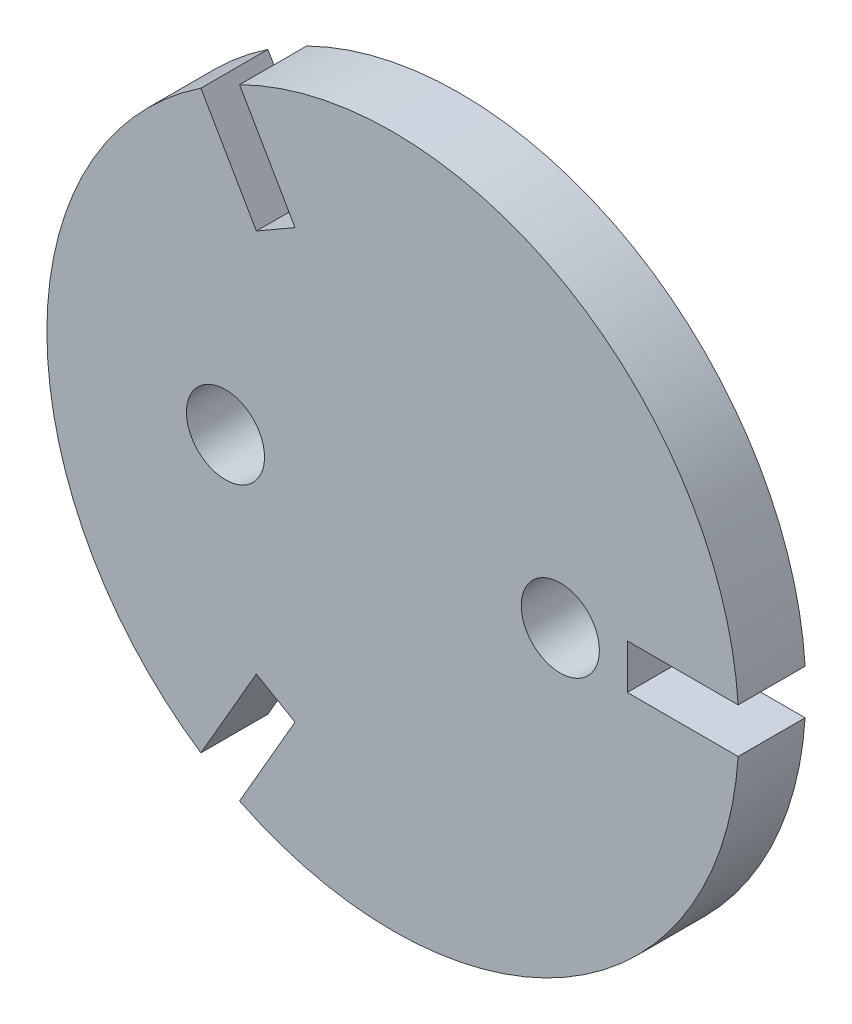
ISO-10303-21;
HEADER;
FILE_DESCRIPTION(('STEP AP214'),'2;1');
FILE_NAME('part.step','',(''),(''),'','','');
FILE_SCHEMA(('AUTOMOTIVE_DESIGN { 1 0 10303 214 1 1 1 1 }'));
ENDSEC;
DATA;
#1=APPLICATION_CONTEXT('core data for automotive mechanical design processes');
#2=APPLICATION_PROTOCOL_DEFINITION('international standard','automotive_design',2000,#1);
#3=PRODUCT_CONTEXT('',#1,'mechanical');
#4=PRODUCT('Part','Part','',(#3));
#5=PRODUCT_RELATED_PRODUCT_CATEGORY('part','',(#4));
#6=PRODUCT_DEFINITION_FORMATION('','',#4);
#7=PRODUCT_DEFINITION_CONTEXT('part definition',#1,'design');
#8=PRODUCT_DEFINITION('design','',#6,#7);
#9=PRODUCT_DEFINITION_SHAPE('','',#8);
#10=(LENGTH_UNIT() NAMED_UNIT(*) SI_UNIT(.MILLI.,.METRE.));
#11=(NAMED_UNIT(*) PLANE_ANGLE_UNIT() SI_UNIT($,.RADIAN.));
#12=(NAMED_UNIT(*) SI_UNIT($,.STERADIAN.) SOLID_ANGLE_UNIT());
#13=UNCERTAINTY_MEASURE_WITH_UNIT(LENGTH_MEASURE(1.E-05),#10,'distance_accuracy_value','');
#14=(GEOMETRIC_REPRESENTATION_CONTEXT(3) GLOBAL_UNCERTAINTY_ASSIGNED_CONTEXT((#13)) GLOBAL_UNIT_ASSIGNED_CONTEXT((#10,
#11,#12)) REPRESENTATION_CONTEXT('',''));
#15=CARTESIAN_POINT('',(0.,0.,0.));
#16=DIRECTION('',(0.,0.,1.));
#17=DIRECTION('',(1.,0.,0.));
#18=AXIS2_PLACEMENT_3D('',#15,#16,#17);
#19=CARTESIAN_POINT('',(0.,0.,3.));
#20=DIRECTION('',(0.,0.,-1.));
#21=DIRECTION('',(-1.,0.,0.));
#22=AXIS2_PLACEMENT_3D('',#19,#20,#21);
#23=CYLINDRICAL_SURFACE('',#22,15.5);
#24=CARTESIAN_POINT('',(0.,0.,0.));
#25=DIRECTION('',(0.,0.,1.));
#26=DIRECTION('',(1.,0.,0.));
#27=AXIS2_PLACEMENT_3D('',#24,#25,#26);
#28=CIRCLE('',#27,15.5);
#29=CARTESIAN_POINT('',(-6.86782874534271,-13.8954283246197,0.));
#30=VERTEX_POINT('',#29);
#31=CARTESIAN_POINT('',(15.467708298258,-1.,0.));
#32=VERTEX_POINT('',#31);
#33=EDGE_CURVE('E203',#30,#32,#28,.T.);
#34=ORIENTED_EDGE('',*,*,#33,.T.);
#35=DIRECTION('',(0.,0.,-1.));
#36=VECTOR('',#35,1.);
#37=CARTESIAN_POINT('',(15.467708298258,-1.,3.));
#38=LINE('',#37,#36);
#39=CARTESIAN_POINT('',(15.467708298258,-1.,3.));
#40=VERTEX_POINT('',#39);
#41=EDGE_CURVE('E11',#32,#40,#38,.F.);
#42=ORIENTED_EDGE('',*,*,#41,.T.);
#43=CARTESIAN_POINT('',(0.,0.,3.));
#44=DIRECTION('',(0.,0.,1.));
#45=DIRECTION('',(1.,0.,0.));
#46=AXIS2_PLACEMENT_3D('',#43,#44,#45);
#47=CIRCLE('',#46,15.5);
#48=CARTESIAN_POINT('',(-6.86782874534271,-13.8954283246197,3.));
#49=VERTEX_POINT('',#48);
#50=EDGE_CURVE('E211',#49,#40,#47,.T.);
#51=ORIENTED_EDGE('',*,*,#50,.F.);
#52=DIRECTION('',(0.,0.,-1.));
#53=VECTOR('',#52,1.);
#54=CARTESIAN_POINT('',(-6.86782874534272,-13.8954283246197,3.));
#55=LINE('',#54,#53);
#56=EDGE_CURVE('E218',#49,#30,#55,.T.);
#57=ORIENTED_EDGE('',*,*,#56,.T.);
#58=EDGE_LOOP('',(#34,#42,#51,#57));
#59=FACE_BOUND('',#58,.T.);
#60=ADVANCED_FACE('F32',(#59),#23,.T.);
#61=CARTESIAN_POINT('',(-8.599879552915,12.8954283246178,0.));
#62=VERTEX_POINT('',#61);
#63=CARTESIAN_POINT('',(-8.59987955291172,-12.89542832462,0.));
#64=VERTEX_POINT('',#63);
#65=EDGE_CURVE('E213',#62,#64,#28,.T.);
#66=ORIENTED_EDGE('',*,*,#65,.T.);
#67=DIRECTION('',(0.,0.,-1.));
#68=VECTOR('',#67,1.);
#69=CARTESIAN_POINT('',(-8.59987955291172,-12.89542832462,3.));
#70=LINE('',#69,#68);
#71=CARTESIAN_POINT('',(-8.59987955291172,-12.89542832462,3.));
#72=VERTEX_POINT('',#71);
#73=EDGE_CURVE('E220',#64,#72,#70,.F.);
#74=ORIENTED_EDGE('',*,*,#73,.T.);
#75=CARTESIAN_POINT('',(-8.599879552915,12.8954283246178,3.));
#76=VERTEX_POINT('',#75);
#77=EDGE_CURVE('E210',#76,#72,#47,.T.);
#78=ORIENTED_EDGE('',*,*,#77,.F.);
#79=DIRECTION('',(0.,0.,-1.));
#80=VECTOR('',#79,1.);
#81=CARTESIAN_POINT('',(-8.599879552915,12.8954283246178,3.));
#82=LINE('',#81,#80);
#83=EDGE_CURVE('E209',#76,#62,#82,.T.);
#84=ORIENTED_EDGE('',*,*,#83,.T.);
#85=EDGE_LOOP('',(#66,#74,#78,#84));
#86=FACE_BOUND('',#85,.T.);
#87=ADVANCED_FACE('F240',(#86),#23,.T.);
#88=CARTESIAN_POINT('',(0.,0.,3.));
#89=DIRECTION('',(0.,0.,1.));
#90=DIRECTION('',(1.,0.,0.));
#91=AXIS2_PLACEMENT_3D('',#88,#89,#90);
#92=PLANE('',#91);
#93=DIRECTION('',(1.,0.,0.));
#94=VECTOR('',#93,1.);
#95=CARTESIAN_POINT('',(16.2130393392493,-1.,3.));
#96=LINE('',#95,#94);
#97=CARTESIAN_POINT('',(10.5,-1.,3.));
#98=VERTEX_POINT('',#97);
#99=EDGE_CURVE('E147',#98,#40,#96,.T.);
#100=ORIENTED_EDGE('',*,*,#99,.F.);
#101=DIRECTION('',(0.,-1.,0.));
#102=VECTOR('',#101,1.);
#103=CARTESIAN_POINT('',(10.5,-1.,3.));
#104=LINE('',#103,#102);
#105=CARTESIAN_POINT('',(10.5,0.999999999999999,3.));
#106=VERTEX_POINT('',#105);
#107=EDGE_CURVE('E149',#106,#98,#104,.T.);
#108=ORIENTED_EDGE('',*,*,#107,.F.);
#109=DIRECTION('',(-1.,0.,0.));
#110=VECTOR('',#109,1.);
#111=CARTESIAN_POINT('',(16.2130393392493,1.,3.));
#112=LINE('',#111,#110);
#113=CARTESIAN_POINT('',(15.467708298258,1.,3.));
#114=VERTEX_POINT('',#113);
#115=EDGE_CURVE('E127',#114,#106,#112,.T.);
#116=ORIENTED_EDGE('',*,*,#115,.F.);
#117=CARTESIAN_POINT('',(-6.86782874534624,13.895428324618,3.));
#118=VERTEX_POINT('',#117);
#119=EDGE_CURVE('E206',#114,#118,#47,.T.);
#120=ORIENTED_EDGE('',*,*,#119,.T.);
#121=DIRECTION('',(-0.5,0.866025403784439,0.));
#122=VECTOR('',#121,1.);
#123=CARTESIAN_POINT('',(-7.24049426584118,14.5409039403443,3.));
#124=LINE('',#123,#122);
#125=CARTESIAN_POINT('',(-4.38397459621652,9.59326673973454,3.));
#126=VERTEX_POINT('',#125);
#127=EDGE_CURVE('E179',#126,#118,#124,.T.);
#128=ORIENTED_EDGE('',*,*,#127,.F.);
#129=DIRECTION('',(0.866025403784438,0.500000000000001,0.));
#130=VECTOR('',#129,1.);
#131=CARTESIAN_POINT('',(-4.38397459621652,9.59326673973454,3.));
#132=LINE('',#131,#130);
#133=CARTESIAN_POINT('',(-6.11602540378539,8.59326673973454,3.));
#134=VERTEX_POINT('',#133);
#135=EDGE_CURVE('E187',#134,#126,#132,.T.);
#136=ORIENTED_EDGE('',*,*,#135,.F.);
#137=DIRECTION('',(0.5,-0.866025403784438,0.));
#138=VECTOR('',#137,1.);
#139=CARTESIAN_POINT('',(-8.97254507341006,13.5409039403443,3.));
#140=LINE('',#139,#138);
#141=EDGE_CURVE('E185',#76,#134,#140,.T.);
#142=ORIENTED_EDGE('',*,*,#141,.F.);
#143=ORIENTED_EDGE('',*,*,#77,.T.);
#144=DIRECTION('',(-0.499999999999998,-0.86602540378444,0.));
#145=VECTOR('',#144,1.);
#146=CARTESIAN_POINT('',(-8.97254507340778,-13.5409039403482,3.));
#147=LINE('',#146,#145);
#148=CARTESIAN_POINT('',(-6.11602540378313,-8.59326673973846,3.));
#149=VERTEX_POINT('',#148);
#150=EDGE_CURVE('E160',#149,#72,#147,.T.);
#151=ORIENTED_EDGE('',*,*,#150,.F.);
#152=DIRECTION('',(-0.866025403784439,0.5,0.));
#153=VECTOR('',#152,1.);
#154=CARTESIAN_POINT('',(-6.11602540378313,-8.59326673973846,3.));
#155=LINE('',#154,#153);
#156=CARTESIAN_POINT('',(-4.38397459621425,-9.59326673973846,3.));
#157=VERTEX_POINT('',#156);
#158=EDGE_CURVE('E169',#157,#149,#155,.T.);
#159=ORIENTED_EDGE('',*,*,#158,.F.);
#160=DIRECTION('',(0.5,0.866025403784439,0.));
#161=VECTOR('',#160,1.);
#162=CARTESIAN_POINT('',(-7.24049426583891,-14.5409039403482,3.));
#163=LINE('',#162,#161);
#164=EDGE_CURVE('E167',#49,#157,#163,.T.);
#165=ORIENTED_EDGE('',*,*,#164,.F.);
#166=ORIENTED_EDGE('',*,*,#50,.T.);
#167=EDGE_LOOP('',(#100,#108,#116,#120,#128,#136,#142,#143,#151,#159,#165,#166));
#168=FACE_BOUND('',#167,.T.);
#169=CARTESIAN_POINT('',(7.5,0.,3.));
#170=DIRECTION('',(0.,0.,1.));
#171=DIRECTION('',(1.,0.,0.));
#172=AXIS2_PLACEMENT_3D('',#169,#170,#171);
#173=CIRCLE('',#172,1.75);
#174=CARTESIAN_POINT('',(9.25,0.,3.));
#175=VERTEX_POINT('',#174);
#176=EDGE_CURVE('E200',#175,#175,#173,.T.);
#177=ORIENTED_EDGE('',*,*,#176,.F.);
#178=EDGE_LOOP('',(#177));
#179=FACE_BOUND('',#178,.T.);
#180=CARTESIAN_POINT('',(-7.5,0.,3.));
#181=DIRECTION('',(0.,0.,1.));
#182=DIRECTION('',(1.,0.,0.));
#183=AXIS2_PLACEMENT_3D('',#180,#181,#182);
#184=CIRCLE('',#183,1.75);
#185=CARTESIAN_POINT('',(-5.75,0.,3.));
#186=VERTEX_POINT('',#185);
#187=EDGE_CURVE('E194',#186,#186,#184,.T.);
#188=ORIENTED_EDGE('',*,*,#187,.F.);
#189=EDGE_LOOP('',(#188));
#190=FACE_BOUND('',#189,.T.);
#191=ADVANCED_FACE('F226',(#168,#179,#190),#92,.T.);
#192=CARTESIAN_POINT('',(0.,0.,0.));
#193=DIRECTION('',(0.,0.,1.));
#194=DIRECTION('',(1.,0.,0.));
#195=AXIS2_PLACEMENT_3D('',#192,#193,#194);
#196=PLANE('',#195);
#197=DIRECTION('',(0.,-1.,0.));
#198=VECTOR('',#197,1.);
#199=CARTESIAN_POINT('',(10.5,-1.,0.));
#200=LINE('',#199,#198);
#201=CARTESIAN_POINT('',(10.5,0.999999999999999,0.));
#202=VERTEX_POINT('',#201);
#203=CARTESIAN_POINT('',(10.5,-1.,0.));
#204=VERTEX_POINT('',#203);
#205=EDGE_CURVE('E135',#202,#204,#200,.T.);
#206=ORIENTED_EDGE('',*,*,#205,.T.);
#207=DIRECTION('',(1.,0.,0.));
#208=VECTOR('',#207,1.);
#209=CARTESIAN_POINT('',(16.2130393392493,-1.,0.));
#210=LINE('',#209,#208);
#211=EDGE_CURVE('E132',#204,#32,#210,.T.);
#212=ORIENTED_EDGE('',*,*,#211,.T.);
#213=ORIENTED_EDGE('',*,*,#33,.F.);
#214=DIRECTION('',(0.5,0.866025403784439,0.));
#215=VECTOR('',#214,1.);
#216=CARTESIAN_POINT('',(-7.24049426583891,-14.5409039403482,0.));
#217=LINE('',#216,#215);
#218=CARTESIAN_POINT('',(-4.38397459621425,-9.59326673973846,0.));
#219=VERTEX_POINT('',#218);
#220=EDGE_CURVE('E47',#30,#219,#217,.T.);
#221=ORIENTED_EDGE('',*,*,#220,.T.);
#222=DIRECTION('',(-0.866025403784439,0.5,0.));
#223=VECTOR('',#222,1.);
#224=CARTESIAN_POINT('',(-6.11602540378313,-8.59326673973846,0.));
#225=LINE('',#224,#223);
#226=CARTESIAN_POINT('',(-6.11602540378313,-8.59326673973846,0.));
#227=VERTEX_POINT('',#226);
#228=EDGE_CURVE('E159',#219,#227,#225,.T.);
#229=ORIENTED_EDGE('',*,*,#228,.T.);
#230=DIRECTION('',(-0.499999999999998,-0.86602540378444,0.));
#231=VECTOR('',#230,1.);
#232=CARTESIAN_POINT('',(-8.97254507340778,-13.5409039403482,0.));
#233=LINE('',#232,#231);
#234=EDGE_CURVE('E163',#227,#64,#233,.T.);
#235=ORIENTED_EDGE('',*,*,#234,.T.);
#236=ORIENTED_EDGE('',*,*,#65,.F.);
#237=DIRECTION('',(0.5,-0.866025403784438,0.));
#238=VECTOR('',#237,1.);
#239=CARTESIAN_POINT('',(-8.97254507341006,13.5409039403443,0.));
#240=LINE('',#239,#238);
#241=CARTESIAN_POINT('',(-6.11602540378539,8.59326673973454,0.));
#242=VERTEX_POINT('',#241);
#243=EDGE_CURVE('E55',#62,#242,#240,.T.);
#244=ORIENTED_EDGE('',*,*,#243,.T.);
#245=DIRECTION('',(0.866025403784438,0.500000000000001,0.));
#246=VECTOR('',#245,1.);
#247=CARTESIAN_POINT('',(-4.38397459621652,9.59326673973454,0.));
#248=LINE('',#247,#246);
#249=CARTESIAN_POINT('',(-4.38397459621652,9.59326673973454,0.));
#250=VERTEX_POINT('',#249);
#251=EDGE_CURVE('E178',#242,#250,#248,.T.);
#252=ORIENTED_EDGE('',*,*,#251,.T.);
#253=DIRECTION('',(-0.5,0.866025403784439,0.));
#254=VECTOR('',#253,1.);
#255=CARTESIAN_POINT('',(-7.24049426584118,14.5409039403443,0.));
#256=LINE('',#255,#254);
#257=CARTESIAN_POINT('',(-6.86782874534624,13.895428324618,0.));
#258=VERTEX_POINT('',#257);
#259=EDGE_CURVE('E182',#250,#258,#256,.T.);
#260=ORIENTED_EDGE('',*,*,#259,.T.);
#261=CARTESIAN_POINT('',(15.467708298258,1.,0.));
#262=VERTEX_POINT('',#261);
#263=EDGE_CURVE('E146',#262,#258,#28,.T.);
#264=ORIENTED_EDGE('',*,*,#263,.F.);
#265=DIRECTION('',(-1.,0.,0.));
#266=VECTOR('',#265,1.);
#267=CARTESIAN_POINT('',(16.2130393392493,1.,0.));
#268=LINE('',#267,#266);
#269=EDGE_CURVE('E124',#262,#202,#268,.T.);
#270=ORIENTED_EDGE('',*,*,#269,.T.);
#271=EDGE_LOOP('',(#206,#212,#213,#221,#229,#235,#236,#244,#252,#260,#264,#270));
#272=FACE_BOUND('',#271,.T.);
#273=CARTESIAN_POINT('',(7.5,0.,0.));
#274=DIRECTION('',(0.,0.,1.));
#275=DIRECTION('',(1.,0.,0.));
#276=AXIS2_PLACEMENT_3D('',#273,#274,#275);
#277=CIRCLE('',#276,1.75);
#278=CARTESIAN_POINT('',(9.25,0.,0.));
#279=VERTEX_POINT('',#278);
#280=EDGE_CURVE('E197',#279,#279,#277,.T.);
#281=ORIENTED_EDGE('',*,*,#280,.T.);
#282=EDGE_LOOP('',(#281));
#283=FACE_BOUND('',#282,.T.);
#284=CARTESIAN_POINT('',(-7.5,0.,0.));
#285=DIRECTION('',(0.,0.,1.));
#286=DIRECTION('',(1.,0.,0.));
#287=AXIS2_PLACEMENT_3D('',#284,#285,#286);
#288=CIRCLE('',#287,1.75);
#289=CARTESIAN_POINT('',(-5.75,0.,0.));
#290=VERTEX_POINT('',#289);
#291=EDGE_CURVE('E156',#290,#290,#288,.T.);
#292=ORIENTED_EDGE('',*,*,#291,.T.);
#293=EDGE_LOOP('',(#292));
#294=FACE_BOUND('',#293,.T.);
#295=ADVANCED_FACE('F142',(#272,#283,#294),#196,.F.);
#296=ORIENTED_EDGE('',*,*,#119,.F.);
#297=DIRECTION('',(0.,0.,-1.));
#298=VECTOR('',#297,1.);
#299=CARTESIAN_POINT('',(15.467708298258,1.,3.));
#300=LINE('',#299,#298);
#301=EDGE_CURVE('E40',#114,#262,#300,.T.);
#302=ORIENTED_EDGE('',*,*,#301,.T.);
#303=ORIENTED_EDGE('',*,*,#263,.T.);
#304=DIRECTION('',(0.,0.,-1.));
#305=VECTOR('',#304,1.);
#306=CARTESIAN_POINT('',(-6.86782874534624,13.895428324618,3.));
#307=LINE('',#306,#305);
#308=EDGE_CURVE('E215',#258,#118,#307,.F.);
#309=ORIENTED_EDGE('',*,*,#308,.T.);
#310=EDGE_LOOP('',(#296,#302,#303,#309));
#311=FACE_BOUND('',#310,.T.);
#312=ADVANCED_FACE('F34',(#311),#23,.T.);
#313=CARTESIAN_POINT('',(7.5,0.,3.));
#314=DIRECTION('',(0.,0.,-1.));
#315=DIRECTION('',(-1.,0.,0.));
#316=AXIS2_PLACEMENT_3D('',#313,#314,#315);
#317=CYLINDRICAL_SURFACE('',#316,1.75);
#318=ORIENTED_EDGE('',*,*,#176,.T.);
#319=EDGE_LOOP('',(#318));
#320=FACE_BOUND('',#319,.T.);
#321=ORIENTED_EDGE('',*,*,#280,.F.);
#322=EDGE_LOOP('',(#321));
#323=FACE_BOUND('',#322,.T.);
#324=ADVANCED_FACE('F266',(#320,#323),#317,.F.);
#325=CARTESIAN_POINT('',(-7.5,0.,3.));
#326=DIRECTION('',(0.,0.,-1.));
#327=DIRECTION('',(-1.,0.,0.));
#328=AXIS2_PLACEMENT_3D('',#325,#326,#327);
#329=CYLINDRICAL_SURFACE('',#328,1.75);
#330=ORIENTED_EDGE('',*,*,#187,.T.);
#331=EDGE_LOOP('',(#330));
#332=FACE_BOUND('',#331,.T.);
#333=ORIENTED_EDGE('',*,*,#291,.F.);
#334=EDGE_LOOP('',(#333));
#335=FACE_BOUND('',#334,.T.);
#336=ADVANCED_FACE('F259',(#332,#335),#329,.F.);
#337=CARTESIAN_POINT('',(-7.24049426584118,14.5409039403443,0.));
#338=DIRECTION('',(0.866025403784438,0.5,0.));
#339=DIRECTION('',(-0.5,0.866025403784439,0.));
#340=AXIS2_PLACEMENT_3D('',#337,#338,#339);
#341=PLANE('',#340);
#342=ORIENTED_EDGE('',*,*,#259,.F.);
#343=DIRECTION('',(0.,0.,1.));
#344=VECTOR('',#343,1.);
#345=CARTESIAN_POINT('',(-4.38397459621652,9.59326673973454,0.));
#346=LINE('',#345,#344);
#347=EDGE_CURVE('E170',#250,#126,#346,.T.);
#348=ORIENTED_EDGE('',*,*,#347,.T.);
#349=ORIENTED_EDGE('',*,*,#127,.T.);
#350=ORIENTED_EDGE('',*,*,#308,.F.);
#351=EDGE_LOOP('',(#342,#348,#349,#350));
#352=FACE_BOUND('',#351,.T.);
#353=ADVANCED_FACE('F257',(#352),#341,.F.);
#354=CARTESIAN_POINT('',(-8.97254507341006,13.5409039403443,0.));
#355=DIRECTION('',(-0.866025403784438,-0.500000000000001,0.));
#356=DIRECTION('',(0.500000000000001,-0.866025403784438,0.));
#357=AXIS2_PLACEMENT_3D('',#354,#355,#356);
#358=PLANE('',#357);
#359=ORIENTED_EDGE('',*,*,#141,.T.);
#360=DIRECTION('',(0.,0.,1.));
#361=VECTOR('',#360,1.);
#362=CARTESIAN_POINT('',(-6.11602540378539,8.59326673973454,0.));
#363=LINE('',#362,#361);
#364=EDGE_CURVE('E184',#242,#134,#363,.T.);
#365=ORIENTED_EDGE('',*,*,#364,.F.);
#366=ORIENTED_EDGE('',*,*,#243,.F.);
#367=ORIENTED_EDGE('',*,*,#83,.F.);
#368=EDGE_LOOP('',(#359,#365,#366,#367));
#369=FACE_BOUND('',#368,.T.);
#370=ADVANCED_FACE('F251',(#369),#358,.F.);
#371=CARTESIAN_POINT('',(-4.38397459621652,9.59326673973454,0.));
#372=DIRECTION('',(0.500000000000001,-0.866025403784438,0.));
#373=DIRECTION('',(0.866025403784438,0.500000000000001,0.));
#374=AXIS2_PLACEMENT_3D('',#371,#372,#373);
#375=PLANE('',#374);
#376=ORIENTED_EDGE('',*,*,#135,.T.);
#377=ORIENTED_EDGE('',*,*,#347,.F.);
#378=ORIENTED_EDGE('',*,*,#251,.F.);
#379=ORIENTED_EDGE('',*,*,#364,.T.);
#380=EDGE_LOOP('',(#376,#377,#378,#379));
#381=FACE_BOUND('',#380,.T.);
#382=ADVANCED_FACE('F254',(#381),#375,.F.);
#383=CARTESIAN_POINT('',(-8.97254507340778,-13.5409039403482,0.));
#384=DIRECTION('',(-0.86602540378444,0.499999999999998,0.));
#385=DIRECTION('',(-0.499999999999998,-0.86602540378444,0.));
#386=AXIS2_PLACEMENT_3D('',#383,#384,#385);
#387=PLANE('',#386);
#388=ORIENTED_EDGE('',*,*,#234,.F.);
#389=DIRECTION('',(0.,0.,1.));
#390=VECTOR('',#389,1.);
#391=CARTESIAN_POINT('',(-6.11602540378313,-8.59326673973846,0.));
#392=LINE('',#391,#390);
#393=EDGE_CURVE('E154',#227,#149,#392,.T.);
#394=ORIENTED_EDGE('',*,*,#393,.T.);
#395=ORIENTED_EDGE('',*,*,#150,.T.);
#396=ORIENTED_EDGE('',*,*,#73,.F.);
#397=EDGE_LOOP('',(#388,#394,#395,#396));
#398=FACE_BOUND('',#397,.T.);
#399=ADVANCED_FACE('F246',(#398),#387,.F.);
#400=CARTESIAN_POINT('',(-7.24049426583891,-14.5409039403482,0.));
#401=DIRECTION('',(0.866025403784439,-0.5,0.));
#402=DIRECTION('',(0.5,0.866025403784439,0.));
#403=AXIS2_PLACEMENT_3D('',#400,#401,#402);
#404=PLANE('',#403);
#405=ORIENTED_EDGE('',*,*,#164,.T.);
#406=DIRECTION('',(0.,0.,1.));
#407=VECTOR('',#406,1.);
#408=CARTESIAN_POINT('',(-4.38397459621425,-9.59326673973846,0.));
#409=LINE('',#408,#407);
#410=EDGE_CURVE('E166',#219,#157,#409,.T.);
#411=ORIENTED_EDGE('',*,*,#410,.F.);
#412=ORIENTED_EDGE('',*,*,#220,.F.);
#413=ORIENTED_EDGE('',*,*,#56,.F.);
#414=EDGE_LOOP('',(#405,#411,#412,#413));
#415=FACE_BOUND('',#414,.T.);
#416=ADVANCED_FACE('F290',(#415),#404,.F.);
#417=CARTESIAN_POINT('',(-6.11602540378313,-8.59326673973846,0.));
#418=DIRECTION('',(0.5,0.866025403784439,0.));
#419=DIRECTION('',(-0.866025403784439,0.5,0.));
#420=AXIS2_PLACEMENT_3D('',#417,#418,#419);
#421=PLANE('',#420);
#422=ORIENTED_EDGE('',*,*,#158,.T.);
#423=ORIENTED_EDGE('',*,*,#393,.F.);
#424=ORIENTED_EDGE('',*,*,#228,.F.);
#425=ORIENTED_EDGE('',*,*,#410,.T.);
#426=EDGE_LOOP('',(#422,#423,#424,#425));
#427=FACE_BOUND('',#426,.T.);
#428=ADVANCED_FACE('F295',(#427),#421,.F.);
#429=CARTESIAN_POINT('',(16.2130393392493,-1.,0.));
#430=DIRECTION('',(0.,-1.,0.));
#431=DIRECTION('',(1.,0.,0.));
#432=AXIS2_PLACEMENT_3D('',#429,#430,#431);
#433=PLANE('',#432);
#434=ORIENTED_EDGE('',*,*,#211,.F.);
#435=DIRECTION('',(0.,0.,1.));
#436=VECTOR('',#435,1.);
#437=CARTESIAN_POINT('',(10.5,-1.,0.));
#438=LINE('',#437,#436);
#439=EDGE_CURVE('E131',#204,#98,#438,.T.);
#440=ORIENTED_EDGE('',*,*,#439,.T.);
#441=ORIENTED_EDGE('',*,*,#99,.T.);
#442=ORIENTED_EDGE('',*,*,#41,.F.);
#443=EDGE_LOOP('',(#434,#440,#441,#442));
#444=FACE_BOUND('',#443,.T.);
#445=ADVANCED_FACE('F233',(#444),#433,.F.);
#446=CARTESIAN_POINT('',(16.2130393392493,1.,0.));
#447=DIRECTION('',(0.,1.,0.));
#448=DIRECTION('',(-1.,0.,0.));
#449=AXIS2_PLACEMENT_3D('',#446,#447,#448);
#450=PLANE('',#449);
#451=ORIENTED_EDGE('',*,*,#115,.T.);
#452=DIRECTION('',(0.,0.,1.));
#453=VECTOR('',#452,1.);
#454=CARTESIAN_POINT('',(10.5,0.999999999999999,0.));
#455=LINE('',#454,#453);
#456=EDGE_CURVE('E120',#202,#106,#455,.T.);
#457=ORIENTED_EDGE('',*,*,#456,.F.);
#458=ORIENTED_EDGE('',*,*,#269,.F.);
#459=ORIENTED_EDGE('',*,*,#301,.F.);
#460=EDGE_LOOP('',(#451,#457,#458,#459));
#461=FACE_BOUND('',#460,.T.);
#462=ADVANCED_FACE('F122',(#461),#450,.F.);
#463=CARTESIAN_POINT('',(10.5,-1.,0.));
#464=DIRECTION('',(-1.,0.,0.));
#465=DIRECTION('',(0.,0.,1.));
#466=AXIS2_PLACEMENT_3D('',#463,#464,#465);
#467=PLANE('',#466);
#468=ORIENTED_EDGE('',*,*,#107,.T.);
#469=ORIENTED_EDGE('',*,*,#439,.F.);
#470=ORIENTED_EDGE('',*,*,#205,.F.);
#471=ORIENTED_EDGE('',*,*,#456,.T.);
#472=EDGE_LOOP('',(#468,#469,#470,#471));
#473=FACE_BOUND('',#472,.T.);
#474=ADVANCED_FACE('F136',(#473),#467,.F.);
#475=CLOSED_SHELL('',(#60,#87,#191,#295,#312,#324,#336,#353,#370,#382,#399,#416,#428,#445,#462,#474));
#476=MANIFOLD_SOLID_BREP('B2',#475);
#477=ADVANCED_BREP_SHAPE_REPRESENTATION('',(#18,#476),#14);
#478=SHAPE_DEFINITION_REPRESENTATION(#9,#477);
ENDSEC;
END-ISO-10303-21;
